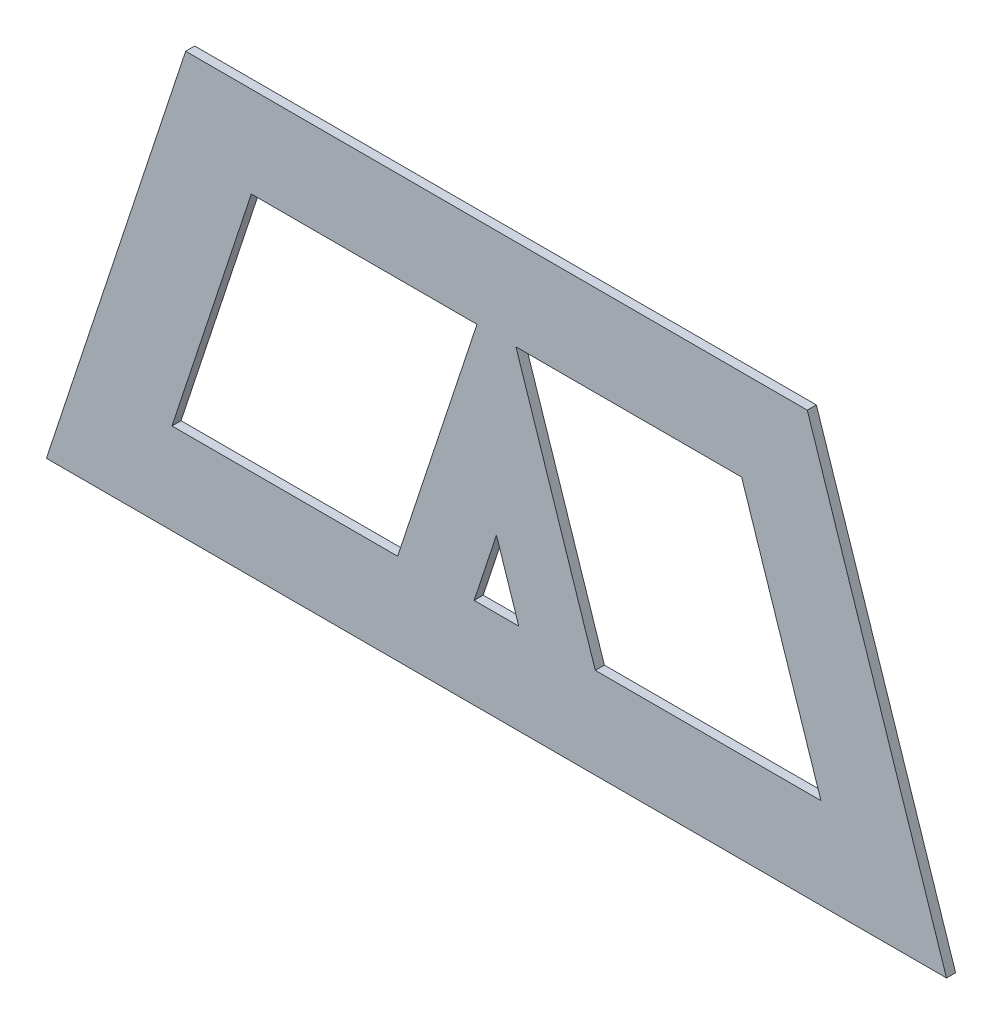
ISO-10303-21;
HEADER;
FILE_DESCRIPTION(('STEP AP214'),'2;1');
FILE_NAME('part.step','',(''),(''),'','','');
FILE_SCHEMA(('AUTOMOTIVE_DESIGN { 1 0 10303 214 1 1 1 1 }'));
ENDSEC;
DATA;
#1=APPLICATION_CONTEXT('core data for automotive mechanical design processes');
#2=APPLICATION_PROTOCOL_DEFINITION('international standard','automotive_design',2000,#1);
#3=PRODUCT_CONTEXT('',#1,'mechanical');
#4=PRODUCT('Part','Part','',(#3));
#5=PRODUCT_RELATED_PRODUCT_CATEGORY('part','',(#4));
#6=PRODUCT_DEFINITION_FORMATION('','',#4);
#7=PRODUCT_DEFINITION_CONTEXT('part definition',#1,'design');
#8=PRODUCT_DEFINITION('design','',#6,#7);
#9=PRODUCT_DEFINITION_SHAPE('','',#8);
#10=(LENGTH_UNIT() NAMED_UNIT(*) SI_UNIT(.MILLI.,.METRE.));
#11=(NAMED_UNIT(*) PLANE_ANGLE_UNIT() SI_UNIT($,.RADIAN.));
#12=(NAMED_UNIT(*) SI_UNIT($,.STERADIAN.) SOLID_ANGLE_UNIT());
#13=UNCERTAINTY_MEASURE_WITH_UNIT(LENGTH_MEASURE(1.E-05),#10,'distance_accuracy_value','');
#14=(GEOMETRIC_REPRESENTATION_CONTEXT(3) GLOBAL_UNCERTAINTY_ASSIGNED_CONTEXT((#13)) GLOBAL_UNIT_ASSIGNED_CONTEXT((#10,
#11,#12)) REPRESENTATION_CONTEXT('',''));
#15=CARTESIAN_POINT('',(0.,0.,0.));
#16=DIRECTION('',(0.,0.,1.));
#17=DIRECTION('',(1.,0.,0.));
#18=AXIS2_PLACEMENT_3D('',#15,#16,#17);
#19=CARTESIAN_POINT('',(343.170614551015,113.193718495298,6.35));
#20=DIRECTION('',(-0.949671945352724,-0.313246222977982,0.));
#21=DIRECTION('',(0.313246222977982,-0.949671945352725,0.));
#22=AXIS2_PLACEMENT_3D('',#19,#20,#21);
#23=PLANE('',#22);
#24=DIRECTION('',(-0.313246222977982,0.949671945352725,0.));
#25=VECTOR('',#24,1.);
#26=CARTESIAN_POINT('',(343.170614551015,113.193718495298,0.));
#27=LINE('',#26,#25);
#28=CARTESIAN_POINT('',(275.856810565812,317.26970246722,0.));
#29=VERTEX_POINT('',#28);
#30=CARTESIAN_POINT('',(178.48363567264,612.477004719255,0.));
#31=VERTEX_POINT('',#30);
#32=EDGE_CURVE('E257',#29,#31,#27,.T.);
#33=ORIENTED_EDGE('',*,*,#32,.T.);
#34=DIRECTION('',(0.,0.,-1.));
#35=VECTOR('',#34,1.);
#36=CARTESIAN_POINT('',(178.48363567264,612.477004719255,6.35));
#37=LINE('',#36,#35);
#38=CARTESIAN_POINT('',(178.48363567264,612.477004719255,6.35));
#39=VERTEX_POINT('',#38);
#40=EDGE_CURVE('E11',#39,#31,#37,.T.);
#41=ORIENTED_EDGE('',*,*,#40,.F.);
#42=DIRECTION('',(-0.313246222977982,0.949671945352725,0.));
#43=VECTOR('',#42,1.);
#44=CARTESIAN_POINT('',(343.170614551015,113.193718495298,6.35));
#45=LINE('',#44,#43);
#46=CARTESIAN_POINT('',(275.856810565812,317.26970246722,6.35));
#47=VERTEX_POINT('',#46);
#48=EDGE_CURVE('E190',#47,#39,#45,.T.);
#49=ORIENTED_EDGE('',*,*,#48,.F.);
#50=DIRECTION('',(0.,0.,-1.));
#51=VECTOR('',#50,1.);
#52=CARTESIAN_POINT('',(275.856810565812,317.26970246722,6.35));
#53=LINE('',#52,#51);
#54=EDGE_CURVE('E268',#47,#29,#53,.T.);
#55=ORIENTED_EDGE('',*,*,#54,.T.);
#56=EDGE_LOOP('',(#33,#41,#49,#55));
#57=FACE_BOUND('',#56,.T.);
#58=ADVANCED_FACE('F40',(#57),#23,.F.);
#59=CARTESIAN_POINT('',(0.,612.477004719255,6.35));
#60=DIRECTION('',(0.,-1.,0.));
#61=DIRECTION('',(0.,0.,-1.));
#62=AXIS2_PLACEMENT_3D('',#59,#60,#61);
#63=PLANE('',#62);
#64=DIRECTION('',(-1.,0.,0.));
#65=VECTOR('',#64,1.);
#66=CARTESIAN_POINT('',(0.,612.477004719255,0.));
#67=LINE('',#66,#65);
#68=CARTESIAN_POINT('',(-256.216267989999,612.477004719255,0.));
#69=VERTEX_POINT('',#68);
#70=EDGE_CURVE('E197',#31,#69,#67,.T.);
#71=ORIENTED_EDGE('',*,*,#70,.T.);
#72=DIRECTION('',(0.,0.,-1.));
#73=VECTOR('',#72,1.);
#74=CARTESIAN_POINT('',(-256.216267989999,612.477004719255,6.35));
#75=LINE('',#74,#73);
#76=CARTESIAN_POINT('',(-256.216267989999,612.477004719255,6.35));
#77=VERTEX_POINT('',#76);
#78=EDGE_CURVE('E51',#77,#69,#75,.T.);
#79=ORIENTED_EDGE('',*,*,#78,.F.);
#80=DIRECTION('',(-1.,0.,0.));
#81=VECTOR('',#80,1.);
#82=CARTESIAN_POINT('',(0.,612.477004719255,6.35));
#83=LINE('',#82,#81);
#84=EDGE_CURVE('E184',#39,#77,#83,.T.);
#85=ORIENTED_EDGE('',*,*,#84,.F.);
#86=ORIENTED_EDGE('',*,*,#40,.T.);
#87=EDGE_LOOP('',(#71,#79,#85,#86));
#88=FACE_BOUND('',#87,.T.);
#89=ADVANCED_FACE('F196',(#88),#63,.F.);
#90=CARTESIAN_POINT('',(-413.275872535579,136.317711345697,6.35));
#91=DIRECTION('',(-0.949671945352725,0.313246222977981,0.));
#92=DIRECTION('',(-0.313246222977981,-0.949671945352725,0.));
#93=AXIS2_PLACEMENT_3D('',#90,#91,#92);
#94=PLANE('',#93);
#95=DIRECTION('',(0.313246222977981,0.949671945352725,0.));
#96=VECTOR('',#95,1.);
#97=CARTESIAN_POINT('',(-413.275872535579,136.317711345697,0.));
#98=LINE('',#97,#96);
#99=CARTESIAN_POINT('',(-353.58944288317,317.26970246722,0.));
#100=VERTEX_POINT('',#99);
#101=EDGE_CURVE('E263',#100,#69,#98,.T.);
#102=ORIENTED_EDGE('',*,*,#101,.F.);
#103=DIRECTION('',(0.,0.,-1.));
#104=VECTOR('',#103,1.);
#105=CARTESIAN_POINT('',(-353.58944288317,317.26970246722,6.35));
#106=LINE('',#105,#104);
#107=CARTESIAN_POINT('',(-353.58944288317,317.26970246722,6.35));
#108=VERTEX_POINT('',#107);
#109=EDGE_CURVE('E127',#108,#100,#106,.T.);
#110=ORIENTED_EDGE('',*,*,#109,.F.);
#111=DIRECTION('',(0.313246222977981,0.949671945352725,0.));
#112=VECTOR('',#111,1.);
#113=CARTESIAN_POINT('',(-413.275872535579,136.317711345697,6.35));
#114=LINE('',#113,#112);
#115=EDGE_CURVE('E188',#108,#77,#114,.T.);
#116=ORIENTED_EDGE('',*,*,#115,.T.);
#117=ORIENTED_EDGE('',*,*,#78,.T.);
#118=EDGE_LOOP('',(#102,#110,#116,#117));
#119=FACE_BOUND('',#118,.T.);
#120=ADVANCED_FACE('F203',(#119),#94,.T.);
#121=CARTESIAN_POINT('',(0.,380.76970246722,6.35));
#122=DIRECTION('',(0.,1.,0.));
#123=DIRECTION('',(0.,0.,1.));
#124=AXIS2_PLACEMENT_3D('',#121,#122,#123);
#125=PLANE('',#124);
#126=DIRECTION('',(1.,0.,0.));
#127=VECTOR('',#126,1.);
#128=CARTESIAN_POINT('',(0.,380.76970246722,0.));
#129=LINE('',#128,#127);
#130=CARTESIAN_POINT('',(-54.4849610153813,380.76970246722,0.));
#131=VERTEX_POINT('',#130);
#132=CARTESIAN_POINT('',(-23.2476713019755,380.76970246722,0.));
#133=VERTEX_POINT('',#132);
#134=EDGE_CURVE('E245',#131,#133,#129,.T.);
#135=ORIENTED_EDGE('',*,*,#134,.F.);
#136=DIRECTION('',(0.,0.,-1.));
#137=VECTOR('',#136,1.);
#138=CARTESIAN_POINT('',(-54.4849610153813,380.76970246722,6.35));
#139=LINE('',#138,#137);
#140=CARTESIAN_POINT('',(-54.4849610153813,380.76970246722,6.35));
#141=VERTEX_POINT('',#140);
#142=EDGE_CURVE('E271',#141,#131,#139,.T.);
#143=ORIENTED_EDGE('',*,*,#142,.F.);
#144=DIRECTION('',(1.,0.,0.));
#145=VECTOR('',#144,1.);
#146=CARTESIAN_POINT('',(0.,380.76970246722,6.35));
#147=LINE('',#146,#145);
#148=CARTESIAN_POINT('',(-23.2476713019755,380.76970246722,6.35));
#149=VERTEX_POINT('',#148);
#150=EDGE_CURVE('E347',#141,#149,#147,.T.);
#151=ORIENTED_EDGE('',*,*,#150,.T.);
#152=DIRECTION('',(0.,0.,-1.));
#153=VECTOR('',#152,1.);
#154=CARTESIAN_POINT('',(-23.2476713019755,380.76970246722,6.35));
#155=LINE('',#154,#153);
#156=EDGE_CURVE('E274',#149,#133,#155,.T.);
#157=ORIENTED_EDGE('',*,*,#156,.T.);
#158=EDGE_LOOP('',(#135,#143,#151,#157));
#159=FACE_BOUND('',#158,.T.);
#160=ADVANCED_FACE('F373',(#159),#125,.T.);
#161=CARTESIAN_POINT('',(-162.410531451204,53.570589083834,6.35));
#162=DIRECTION('',(-0.949671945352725,0.313246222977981,0.));
#163=DIRECTION('',(-0.313246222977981,-0.949671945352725,0.));
#164=AXIS2_PLACEMENT_3D('',#161,#162,#163);
#165=PLANE('',#164);
#166=DIRECTION('',(0.313246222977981,0.949671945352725,0.));
#167=VECTOR('',#166,1.);
#168=CARTESIAN_POINT('',(-162.410531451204,53.570589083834,0.));
#169=LINE('',#168,#167);
#170=CARTESIAN_POINT('',(-38.8663161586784,428.12091616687,0.));
#171=VERTEX_POINT('',#170);
#172=EDGE_CURVE('E249',#131,#171,#169,.T.);
#173=ORIENTED_EDGE('',*,*,#172,.T.);
#174=DIRECTION('',(0.,0.,-1.));
#175=VECTOR('',#174,1.);
#176=CARTESIAN_POINT('',(-38.8663161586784,428.12091616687,6.35));
#177=LINE('',#176,#175);
#178=CARTESIAN_POINT('',(-38.8663161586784,428.12091616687,6.35));
#179=VERTEX_POINT('',#178);
#180=EDGE_CURVE('E277',#179,#171,#177,.T.);
#181=ORIENTED_EDGE('',*,*,#180,.F.);
#182=DIRECTION('',(0.313246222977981,0.949671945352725,0.));
#183=VECTOR('',#182,1.);
#184=CARTESIAN_POINT('',(-162.410531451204,53.570589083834,6.35));
#185=LINE('',#184,#183);
#186=EDGE_CURVE('E351',#141,#179,#185,.T.);
#187=ORIENTED_EDGE('',*,*,#186,.F.);
#188=ORIENTED_EDGE('',*,*,#142,.T.);
#189=EDGE_LOOP('',(#173,#181,#187,#188));
#190=FACE_BOUND('',#189,.T.);
#191=ADVANCED_FACE('F367',(#190),#165,.F.);
#192=CARTESIAN_POINT('',(0.,380.76970246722,6.35));
#193=DIRECTION('',(0.,1.,0.));
#194=DIRECTION('',(0.,0.,1.));
#195=AXIS2_PLACEMENT_3D('',#192,#193,#194);
#196=PLANE('',#195);
#197=DIRECTION('',(1.,0.,0.));
#198=VECTOR('',#197,1.);
#199=CARTESIAN_POINT('',(0.,380.76970246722,0.));
#200=LINE('',#199,#198);
#201=CARTESIAN_POINT('',(30.2444848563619,380.76970246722,0.));
#202=VERTEX_POINT('',#201);
#203=CARTESIAN_POINT('',(188.046345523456,380.76970246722,0.));
#204=VERTEX_POINT('',#203);
#205=EDGE_CURVE('E229',#202,#204,#200,.T.);
#206=ORIENTED_EDGE('',*,*,#205,.F.);
#207=DIRECTION('',(0.,0.,-1.));
#208=VECTOR('',#207,1.);
#209=CARTESIAN_POINT('',(30.2444848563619,380.76970246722,6.35));
#210=LINE('',#209,#208);
#211=CARTESIAN_POINT('',(30.2444848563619,380.76970246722,6.35));
#212=VERTEX_POINT('',#211);
#213=EDGE_CURVE('E278',#212,#202,#210,.T.);
#214=ORIENTED_EDGE('',*,*,#213,.F.);
#215=DIRECTION('',(1.,0.,0.));
#216=VECTOR('',#215,1.);
#217=CARTESIAN_POINT('',(0.,380.76970246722,6.35));
#218=LINE('',#217,#216);
#219=CARTESIAN_POINT('',(188.046345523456,380.76970246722,6.35));
#220=VERTEX_POINT('',#219);
#221=EDGE_CURVE('E324',#212,#220,#218,.T.);
#222=ORIENTED_EDGE('',*,*,#221,.T.);
#223=DIRECTION('',(0.,0.,-1.));
#224=VECTOR('',#223,1.);
#225=CARTESIAN_POINT('',(188.046345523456,380.76970246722,6.35));
#226=LINE('',#225,#224);
#227=EDGE_CURVE('E283',#220,#204,#226,.T.);
#228=ORIENTED_EDGE('',*,*,#227,.T.);
#229=EDGE_LOOP('',(#206,#214,#222,#228));
#230=FACE_BOUND('',#229,.T.);
#231=ADVANCED_FACE('F380',(#230),#196,.T.);
#232=CARTESIAN_POINT('',(140.548608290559,46.3595043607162,6.35));
#233=DIRECTION('',(-0.949671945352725,-0.313246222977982,0.));
#234=DIRECTION('',(0.313246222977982,-0.949671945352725,0.));
#235=AXIS2_PLACEMENT_3D('',#232,#233,#234);
#236=PLANE('',#235);
#237=DIRECTION('',(-0.313246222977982,0.949671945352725,0.));
#238=VECTOR('',#237,1.);
#239=CARTESIAN_POINT('',(140.548608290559,46.3595043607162,0.));
#240=LINE('',#239,#238);
#241=CARTESIAN_POINT('',(-25.2381503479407,548.977004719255,0.));
#242=VERTEX_POINT('',#241);
#243=EDGE_CURVE('E233',#202,#242,#240,.T.);
#244=ORIENTED_EDGE('',*,*,#243,.T.);
#245=DIRECTION('',(0.,0.,-1.));
#246=VECTOR('',#245,1.);
#247=CARTESIAN_POINT('',(-25.2381503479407,548.977004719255,6.35));
#248=LINE('',#247,#246);
#249=CARTESIAN_POINT('',(-25.2381503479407,548.977004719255,6.35));
#250=VERTEX_POINT('',#249);
#251=EDGE_CURVE('E289',#250,#242,#248,.T.);
#252=ORIENTED_EDGE('',*,*,#251,.F.);
#253=DIRECTION('',(-0.313246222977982,0.949671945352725,0.));
#254=VECTOR('',#253,1.);
#255=CARTESIAN_POINT('',(140.548608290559,46.3595043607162,6.35));
#256=LINE('',#255,#254);
#257=EDGE_CURVE('E336',#212,#250,#256,.T.);
#258=ORIENTED_EDGE('',*,*,#257,.F.);
#259=ORIENTED_EDGE('',*,*,#213,.T.);
#260=EDGE_LOOP('',(#244,#252,#258,#259));
#261=FACE_BOUND('',#260,.T.);
#262=ADVANCED_FACE('F409',(#261),#236,.F.);
#263=CARTESIAN_POINT('',(0.,548.977004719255,6.35));
#264=DIRECTION('',(0.,-1.,0.));
#265=DIRECTION('',(0.,0.,-1.));
#266=AXIS2_PLACEMENT_3D('',#263,#264,#265);
#267=PLANE('',#266);
#268=DIRECTION('',(-1.,0.,0.));
#269=VECTOR('',#268,1.);
#270=CARTESIAN_POINT('',(0.,548.977004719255,0.));
#271=LINE('',#270,#269);
#272=CARTESIAN_POINT('',(132.563710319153,548.977004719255,0.));
#273=VERTEX_POINT('',#272);
#274=EDGE_CURVE('E237',#273,#242,#271,.T.);
#275=ORIENTED_EDGE('',*,*,#274,.F.);
#276=DIRECTION('',(0.,0.,-1.));
#277=VECTOR('',#276,1.);
#278=CARTESIAN_POINT('',(132.563710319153,548.977004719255,6.35));
#279=LINE('',#278,#277);
#280=CARTESIAN_POINT('',(132.563710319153,548.977004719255,6.35));
#281=VERTEX_POINT('',#280);
#282=EDGE_CURVE('E286',#281,#273,#279,.T.);
#283=ORIENTED_EDGE('',*,*,#282,.F.);
#284=DIRECTION('',(-1.,0.,0.));
#285=VECTOR('',#284,1.);
#286=CARTESIAN_POINT('',(0.,548.977004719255,6.35));
#287=LINE('',#286,#285);
#288=EDGE_CURVE('E339',#281,#250,#287,.T.);
#289=ORIENTED_EDGE('',*,*,#288,.T.);
#290=ORIENTED_EDGE('',*,*,#251,.T.);
#291=EDGE_LOOP('',(#275,#283,#289,#290));
#292=FACE_BOUND('',#291,.T.);
#293=ADVANCED_FACE('F413',(#292),#267,.T.);
#294=CARTESIAN_POINT('',(-3.862355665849E-13,548.977004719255,6.35));
#295=DIRECTION('',(0.,-1.,0.));
#296=DIRECTION('',(1.,0.,0.));
#297=AXIS2_PLACEMENT_3D('',#294,#295,#296);
#298=PLANE('',#297);
#299=DIRECTION('',(-1.,0.,0.));
#300=VECTOR('',#299,1.);
#301=CARTESIAN_POINT('',(-3.862355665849E-13,548.977004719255,0.));
#302=LINE('',#301,#300);
#303=CARTESIAN_POINT('',(-52.4944819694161,548.977004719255,0.));
#304=VERTEX_POINT('',#303);
#305=CARTESIAN_POINT('',(-210.296342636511,548.977004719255,0.));
#306=VERTEX_POINT('',#305);
#307=EDGE_CURVE('E213',#304,#306,#302,.T.);
#308=ORIENTED_EDGE('',*,*,#307,.F.);
#309=DIRECTION('',(0.,0.,-1.));
#310=VECTOR('',#309,1.);
#311=CARTESIAN_POINT('',(-52.4944819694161,548.977004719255,6.35));
#312=LINE('',#311,#310);
#313=CARTESIAN_POINT('',(-52.4944819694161,548.977004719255,6.35));
#314=VERTEX_POINT('',#313);
#315=EDGE_CURVE('E44',#314,#304,#312,.T.);
#316=ORIENTED_EDGE('',*,*,#315,.F.);
#317=DIRECTION('',(-1.,0.,0.));
#318=VECTOR('',#317,1.);
#319=CARTESIAN_POINT('',(-3.862355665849E-13,548.977004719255,6.35));
#320=LINE('',#319,#318);
#321=CARTESIAN_POINT('',(-210.296342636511,548.977004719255,6.35));
#322=VERTEX_POINT('',#321);
#323=EDGE_CURVE('E267',#314,#322,#320,.T.);
#324=ORIENTED_EDGE('',*,*,#323,.T.);
#325=DIRECTION('',(0.,0.,-1.));
#326=VECTOR('',#325,1.);
#327=CARTESIAN_POINT('',(-210.296342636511,548.977004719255,6.35));
#328=LINE('',#327,#326);
#329=EDGE_CURVE('E209',#322,#306,#328,.T.);
#330=ORIENTED_EDGE('',*,*,#329,.T.);
#331=EDGE_LOOP('',(#308,#316,#324,#330));
#332=FACE_BOUND('',#331,.T.);
#333=ADVANCED_FACE('F42',(#332),#298,.T.);
#334=CARTESIAN_POINT('',(-210.653866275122,69.4834972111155,6.35));
#335=DIRECTION('',(-0.949671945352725,0.313246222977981,0.));
#336=DIRECTION('',(-0.313246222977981,-0.949671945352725,0.));
#337=AXIS2_PLACEMENT_3D('',#334,#335,#336);
#338=PLANE('',#337);
#339=DIRECTION('',(0.313246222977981,0.949671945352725,0.));
#340=VECTOR('',#339,1.);
#341=CARTESIAN_POINT('',(-210.653866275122,69.4834972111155,0.));
#342=LINE('',#341,#340);
#343=CARTESIAN_POINT('',(-107.977117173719,380.76970246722,0.));
#344=VERTEX_POINT('',#343);
#345=EDGE_CURVE('E217',#344,#304,#342,.T.);
#346=ORIENTED_EDGE('',*,*,#345,.F.);
#347=DIRECTION('',(0.,0.,-1.));
#348=VECTOR('',#347,1.);
#349=CARTESIAN_POINT('',(-107.977117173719,380.76970246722,6.35));
#350=LINE('',#349,#348);
#351=CARTESIAN_POINT('',(-107.977117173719,380.76970246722,6.35));
#352=VERTEX_POINT('',#351);
#353=EDGE_CURVE('E297',#352,#344,#350,.T.);
#354=ORIENTED_EDGE('',*,*,#353,.F.);
#355=DIRECTION('',(0.313246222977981,0.949671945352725,0.));
#356=VECTOR('',#355,1.);
#357=CARTESIAN_POINT('',(-210.653866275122,69.4834972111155,6.35));
#358=LINE('',#357,#356);
#359=EDGE_CURVE('E310',#352,#314,#358,.T.);
#360=ORIENTED_EDGE('',*,*,#359,.T.);
#361=ORIENTED_EDGE('',*,*,#315,.T.);
#362=EDGE_LOOP('',(#346,#354,#360,#361));
#363=FACE_BOUND('',#362,.T.);
#364=ADVANCED_FACE('F308',(#363),#338,.T.);
#365=CARTESIAN_POINT('',(0.,380.76970246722,6.35));
#366=DIRECTION('',(0.,1.,0.));
#367=DIRECTION('',(0.,0.,1.));
#368=AXIS2_PLACEMENT_3D('',#365,#366,#367);
#369=PLANE('',#368);
#370=DIRECTION('',(1.,0.,0.));
#371=VECTOR('',#370,1.);
#372=CARTESIAN_POINT('',(0.,380.76970246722,0.));
#373=LINE('',#372,#371);
#374=CARTESIAN_POINT('',(-265.778977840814,380.76970246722,0.));
#375=VERTEX_POINT('',#374);
#376=EDGE_CURVE('E221',#375,#344,#373,.T.);
#377=ORIENTED_EDGE('',*,*,#376,.F.);
#378=DIRECTION('',(0.,0.,-1.));
#379=VECTOR('',#378,1.);
#380=CARTESIAN_POINT('',(-265.778977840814,380.76970246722,6.35));
#381=LINE('',#380,#379);
#382=CARTESIAN_POINT('',(-265.778977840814,380.76970246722,6.35));
#383=VERTEX_POINT('',#382);
#384=EDGE_CURVE('E296',#383,#375,#381,.T.);
#385=ORIENTED_EDGE('',*,*,#384,.F.);
#386=DIRECTION('',(1.,0.,0.));
#387=VECTOR('',#386,1.);
#388=CARTESIAN_POINT('',(0.,380.76970246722,6.35));
#389=LINE('',#388,#387);
#390=EDGE_CURVE('E319',#383,#352,#389,.T.);
#391=ORIENTED_EDGE('',*,*,#390,.T.);
#392=ORIENTED_EDGE('',*,*,#353,.T.);
#393=EDGE_LOOP('',(#377,#385,#391,#392));
#394=FACE_BOUND('',#393,.T.);
#395=ADVANCED_FACE('F316',(#394),#369,.T.);
#396=CARTESIAN_POINT('',(92.3052734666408,30.4465962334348,6.35));
#397=DIRECTION('',(-0.949671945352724,-0.313246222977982,0.));
#398=DIRECTION('',(0.313246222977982,-0.949671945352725,0.));
#399=AXIS2_PLACEMENT_3D('',#396,#397,#398);
#400=PLANE('',#399);
#401=DIRECTION('',(-0.313246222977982,0.949671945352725,0.));
#402=VECTOR('',#401,1.);
#403=CARTESIAN_POINT('',(92.3052734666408,30.4465962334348,0.));
#404=LINE('',#403,#402);
#405=EDGE_CURVE('E253',#133,#171,#404,.T.);
#406=ORIENTED_EDGE('',*,*,#405,.F.);
#407=ORIENTED_EDGE('',*,*,#156,.F.);
#408=DIRECTION('',(-0.313246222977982,0.949671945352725,0.));
#409=VECTOR('',#408,1.);
#410=CARTESIAN_POINT('',(92.3052734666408,30.4465962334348,6.35));
#411=LINE('',#410,#409);
#412=EDGE_CURVE('E354',#149,#179,#411,.T.);
#413=ORIENTED_EDGE('',*,*,#412,.T.);
#414=ORIENTED_EDGE('',*,*,#180,.T.);
#415=EDGE_LOOP('',(#406,#407,#413,#414));
#416=FACE_BOUND('',#415,.T.);
#417=ADVANCED_FACE('F361',(#416),#400,.T.);
#418=CARTESIAN_POINT('',(282.866446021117,93.3025833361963,6.35));
#419=DIRECTION('',(-0.949671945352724,-0.313246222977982,0.));
#420=DIRECTION('',(0.313246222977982,-0.949671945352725,0.));
#421=AXIS2_PLACEMENT_3D('',#418,#419,#420);
#422=PLANE('',#421);
#423=DIRECTION('',(-0.313246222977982,0.949671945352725,0.));
#424=VECTOR('',#423,1.);
#425=CARTESIAN_POINT('',(282.866446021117,93.3025833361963,0.));
#426=LINE('',#425,#424);
#427=EDGE_CURVE('E241',#204,#273,#426,.T.);
#428=ORIENTED_EDGE('',*,*,#427,.F.);
#429=ORIENTED_EDGE('',*,*,#227,.F.);
#430=DIRECTION('',(-0.313246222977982,0.949671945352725,0.));
#431=VECTOR('',#430,1.);
#432=CARTESIAN_POINT('',(282.866446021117,93.3025833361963,6.35));
#433=LINE('',#432,#431);
#434=EDGE_CURVE('E343',#220,#281,#433,.T.);
#435=ORIENTED_EDGE('',*,*,#434,.T.);
#436=ORIENTED_EDGE('',*,*,#282,.T.);
#437=EDGE_LOOP('',(#428,#429,#435,#436));
#438=FACE_BOUND('',#437,.T.);
#439=ADVANCED_FACE('F393',(#438),#422,.T.);
#440=CARTESIAN_POINT('',(-352.971704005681,116.426576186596,6.35));
#441=DIRECTION('',(-0.949671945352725,0.313246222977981,0.));
#442=DIRECTION('',(-0.313246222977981,-0.949671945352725,0.));
#443=AXIS2_PLACEMENT_3D('',#440,#441,#442);
#444=PLANE('',#443);
#445=DIRECTION('',(0.313246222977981,0.949671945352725,0.));
#446=VECTOR('',#445,1.);
#447=CARTESIAN_POINT('',(-352.971704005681,116.426576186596,0.));
#448=LINE('',#447,#446);
#449=EDGE_CURVE('E225',#375,#306,#448,.T.);
#450=ORIENTED_EDGE('',*,*,#449,.T.);
#451=ORIENTED_EDGE('',*,*,#329,.F.);
#452=DIRECTION('',(0.313246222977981,0.949671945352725,0.));
#453=VECTOR('',#452,1.);
#454=CARTESIAN_POINT('',(-352.971704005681,116.426576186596,6.35));
#455=LINE('',#454,#453);
#456=EDGE_CURVE('E321',#383,#322,#455,.T.);
#457=ORIENTED_EDGE('',*,*,#456,.F.);
#458=ORIENTED_EDGE('',*,*,#384,.T.);
#459=EDGE_LOOP('',(#450,#451,#457,#458));
#460=FACE_BOUND('',#459,.T.);
#461=ADVANCED_FACE('F322',(#460),#444,.F.);
#462=CARTESIAN_POINT('',(1.11920637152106E-13,317.26970246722,6.35));
#463=DIRECTION('',(0.,1.,0.));
#464=DIRECTION('',(-1.,0.,0.));
#465=AXIS2_PLACEMENT_3D('',#462,#463,#464);
#466=PLANE('',#465);
#467=DIRECTION('',(1.,0.,0.));
#468=VECTOR('',#467,1.);
#469=CARTESIAN_POINT('',(1.11920637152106E-13,317.26970246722,0.));
#470=LINE('',#469,#468);
#471=EDGE_CURVE('E131',#100,#29,#470,.T.);
#472=ORIENTED_EDGE('',*,*,#471,.T.);
#473=ORIENTED_EDGE('',*,*,#54,.F.);
#474=DIRECTION('',(1.,0.,0.));
#475=VECTOR('',#474,1.);
#476=CARTESIAN_POINT('',(1.11920637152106E-13,317.26970246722,6.35));
#477=LINE('',#476,#475);
#478=EDGE_CURVE('E63',#108,#47,#477,.T.);
#479=ORIENTED_EDGE('',*,*,#478,.F.);
#480=ORIENTED_EDGE('',*,*,#109,.T.);
#481=EDGE_LOOP('',(#472,#473,#479,#480));
#482=FACE_BOUND('',#481,.T.);
#483=ADVANCED_FACE('F406',(#482),#466,.F.);
#484=CARTESIAN_POINT('',(0.,0.,6.35));
#485=DIRECTION('',(0.,0.,1.));
#486=DIRECTION('',(1.,0.,0.));
#487=AXIS2_PLACEMENT_3D('',#484,#485,#486);
#488=PLANE('',#487);
#489=ORIENTED_EDGE('',*,*,#323,.F.);
#490=ORIENTED_EDGE('',*,*,#359,.F.);
#491=ORIENTED_EDGE('',*,*,#390,.F.);
#492=ORIENTED_EDGE('',*,*,#456,.T.);
#493=EDGE_LOOP('',(#489,#490,#491,#492));
#494=FACE_BOUND('',#493,.T.);
#495=ORIENTED_EDGE('',*,*,#221,.F.);
#496=ORIENTED_EDGE('',*,*,#257,.T.);
#497=ORIENTED_EDGE('',*,*,#288,.F.);
#498=ORIENTED_EDGE('',*,*,#434,.F.);
#499=EDGE_LOOP('',(#495,#496,#497,#498));
#500=FACE_BOUND('',#499,.T.);
#501=ORIENTED_EDGE('',*,*,#150,.F.);
#502=ORIENTED_EDGE('',*,*,#186,.T.);
#503=ORIENTED_EDGE('',*,*,#412,.F.);
#504=EDGE_LOOP('',(#501,#502,#503));
#505=FACE_BOUND('',#504,.T.);
#506=ORIENTED_EDGE('',*,*,#48,.T.);
#507=ORIENTED_EDGE('',*,*,#84,.T.);
#508=ORIENTED_EDGE('',*,*,#115,.F.);
#509=ORIENTED_EDGE('',*,*,#478,.T.);
#510=EDGE_LOOP('',(#506,#507,#508,#509));
#511=FACE_BOUND('',#510,.T.);
#512=ADVANCED_FACE('F186',(#494,#500,#505,#511),#488,.T.);
#513=CARTESIAN_POINT('',(0.,0.,0.));
#514=DIRECTION('',(0.,0.,1.));
#515=DIRECTION('',(1.,0.,0.));
#516=AXIS2_PLACEMENT_3D('',#513,#514,#515);
#517=PLANE('',#516);
#518=ORIENTED_EDGE('',*,*,#307,.T.);
#519=ORIENTED_EDGE('',*,*,#449,.F.);
#520=ORIENTED_EDGE('',*,*,#376,.T.);
#521=ORIENTED_EDGE('',*,*,#345,.T.);
#522=EDGE_LOOP('',(#518,#519,#520,#521));
#523=FACE_BOUND('',#522,.T.);
#524=ORIENTED_EDGE('',*,*,#205,.T.);
#525=ORIENTED_EDGE('',*,*,#427,.T.);
#526=ORIENTED_EDGE('',*,*,#274,.T.);
#527=ORIENTED_EDGE('',*,*,#243,.F.);
#528=EDGE_LOOP('',(#524,#525,#526,#527));
#529=FACE_BOUND('',#528,.T.);
#530=ORIENTED_EDGE('',*,*,#134,.T.);
#531=ORIENTED_EDGE('',*,*,#405,.T.);
#532=ORIENTED_EDGE('',*,*,#172,.F.);
#533=EDGE_LOOP('',(#530,#531,#532));
#534=FACE_BOUND('',#533,.T.);
#535=ORIENTED_EDGE('',*,*,#32,.F.);
#536=ORIENTED_EDGE('',*,*,#471,.F.);
#537=ORIENTED_EDGE('',*,*,#101,.T.);
#538=ORIENTED_EDGE('',*,*,#70,.F.);
#539=EDGE_LOOP('',(#535,#536,#537,#538));
#540=FACE_BOUND('',#539,.T.);
#541=ADVANCED_FACE('F314',(#523,#529,#534,#540),#517,.F.);
#542=CLOSED_SHELL('',(#58,#89,#120,#160,#191,#231,#262,#293,#333,#364,#395,#417,#439,#461,#483,
#512,#541));
#543=MANIFOLD_SOLID_BREP('B2',#542);
#544=ADVANCED_BREP_SHAPE_REPRESENTATION('',(#18,#543),#14);
#545=SHAPE_DEFINITION_REPRESENTATION(#9,#544);
ENDSEC;
END-ISO-10303-21;
